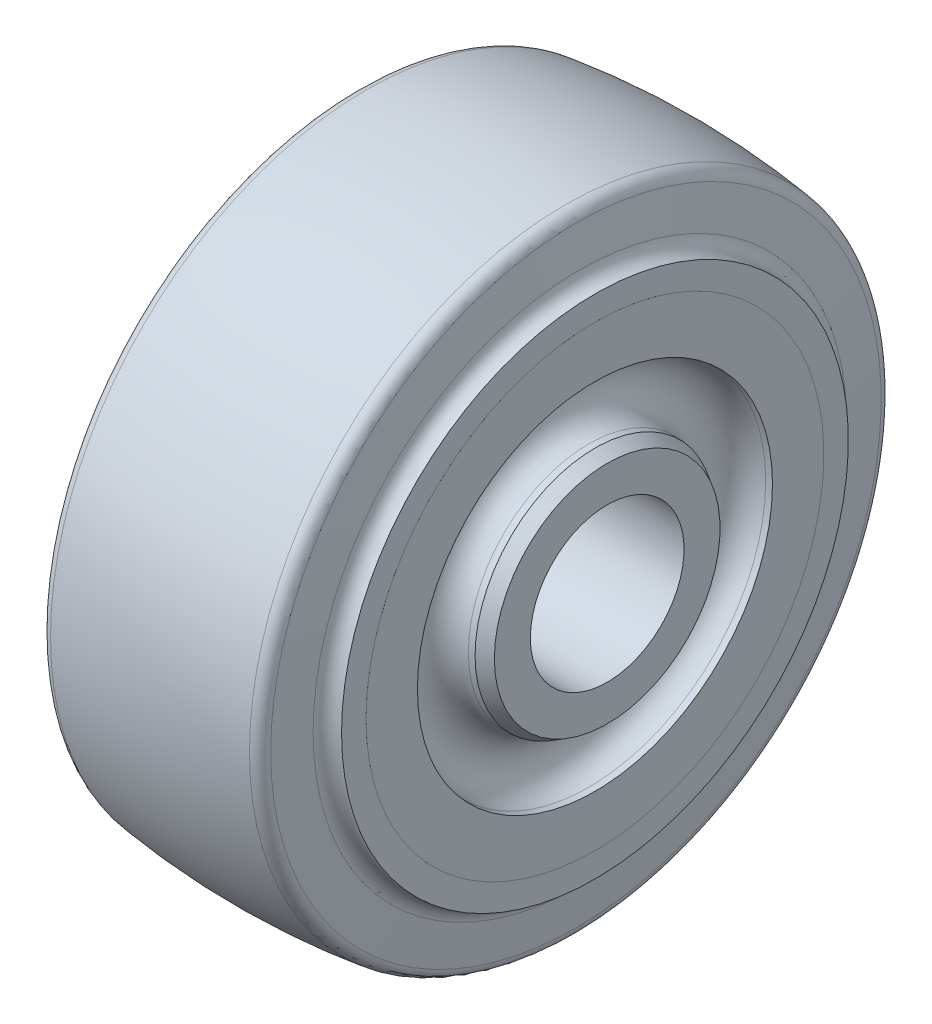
ISO-10303-21;
HEADER;
FILE_DESCRIPTION(('STEP AP214'),'2;1');
FILE_NAME('part.step','',(''),(''),'','','');
FILE_SCHEMA(('AUTOMOTIVE_DESIGN { 1 0 10303 214 1 1 1 1 }'));
ENDSEC;
DATA;
#1=APPLICATION_CONTEXT('core data for automotive mechanical design processes');
#2=APPLICATION_PROTOCOL_DEFINITION('international standard','automotive_design',2000,#1);
#3=PRODUCT_CONTEXT('',#1,'mechanical');
#4=PRODUCT('Part','Part','',(#3));
#5=PRODUCT_RELATED_PRODUCT_CATEGORY('part','',(#4));
#6=PRODUCT_DEFINITION_FORMATION('','',#4);
#7=PRODUCT_DEFINITION_CONTEXT('part definition',#1,'design');
#8=PRODUCT_DEFINITION('design','',#6,#7);
#9=PRODUCT_DEFINITION_SHAPE('','',#8);
#10=(LENGTH_UNIT() NAMED_UNIT(*) SI_UNIT(.MILLI.,.METRE.));
#11=(NAMED_UNIT(*) PLANE_ANGLE_UNIT() SI_UNIT($,.RADIAN.));
#12=(NAMED_UNIT(*) SI_UNIT($,.STERADIAN.) SOLID_ANGLE_UNIT());
#13=UNCERTAINTY_MEASURE_WITH_UNIT(LENGTH_MEASURE(1.E-05),#10,'distance_accuracy_value','');
#14=(GEOMETRIC_REPRESENTATION_CONTEXT(3) GLOBAL_UNCERTAINTY_ASSIGNED_CONTEXT((#13)) GLOBAL_UNIT_ASSIGNED_CONTEXT((#10,
#11,#12)) REPRESENTATION_CONTEXT('',''));
#15=CARTESIAN_POINT('',(0.,0.,0.));
#16=DIRECTION('',(0.,0.,1.));
#17=DIRECTION('',(1.,0.,0.));
#18=AXIS2_PLACEMENT_3D('',#15,#16,#17);
#19=CARTESIAN_POINT('',(25.4,0.,0.));
#20=DIRECTION('',(-1.,0.,0.));
#21=DIRECTION('',(0.,0.,1.));
#22=AXIS2_PLACEMENT_3D('',#19,#20,#21);
#23=CONICAL_SURFACE('',#22,23.618146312,0.0872664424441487);
#24=CARTESIAN_POINT('',(24.1827237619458,0.,0.));
#25=DIRECTION('',(-1.,0.,0.));
#26=DIRECTION('',(0.,0.,1.));
#27=AXIS2_PLACEMENT_3D('',#24,#25,#26);
#28=CIRCLE('',#27,23.7246441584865);
#29=CARTESIAN_POINT('',(24.1827237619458,0.,23.7246441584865));
#30=VERTEX_POINT('',#29);
#31=EDGE_CURVE('E10',#30,#30,#28,.T.);
#32=ORIENTED_EDGE('',*,*,#31,.F.);
#33=EDGE_LOOP('',(#32));
#34=FACE_BOUND('',#33,.T.);
#35=CARTESIAN_POINT('',(25.4,0.,0.));
#36=DIRECTION('',(-1.,0.,0.));
#37=DIRECTION('',(0.,0.,1.));
#38=AXIS2_PLACEMENT_3D('',#35,#36,#37);
#39=CIRCLE('',#38,23.618146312);
#40=CARTESIAN_POINT('',(25.4,0.,23.618146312));
#41=VERTEX_POINT('',#40);
#42=EDGE_CURVE('E436',#41,#41,#39,.T.);
#43=ORIENTED_EDGE('',*,*,#42,.T.);
#44=EDGE_LOOP('',(#43));
#45=FACE_BOUND('',#44,.T.);
#46=ADVANCED_FACE('F360',(#34,#45),#23,.T.);
#47=CARTESIAN_POINT('',(24.6697499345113,0.,0.));
#48=DIRECTION('',(-1.,0.,0.));
#49=DIRECTION('',(0.,0.,1.));
#50=AXIS2_PLACEMENT_3D('',#47,#48,#49);
#51=TOROIDAL_SURFACE('',#50,29.291380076,5.5879999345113);
#52=CARTESIAN_POINT('',(24.1827237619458,0.,0.));
#53=DIRECTION('',(-1.,0.,0.));
#54=DIRECTION('',(0.,0.,1.));
#55=AXIS2_PLACEMENT_3D('',#52,#53,#54);
#56=CIRCLE('',#55,34.8581159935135);
#57=CARTESIAN_POINT('',(24.1827237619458,0.,34.8581159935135));
#58=VERTEX_POINT('',#57);
#59=EDGE_CURVE('E366',#58,#58,#56,.T.);
#60=ORIENTED_EDGE('',*,*,#59,.F.);
#61=EDGE_LOOP('',(#60));
#62=FACE_BOUND('',#61,.T.);
#63=ORIENTED_EDGE('',*,*,#31,.T.);
#64=EDGE_LOOP('',(#63));
#65=FACE_BOUND('',#64,.T.);
#66=ADVANCED_FACE('F569',(#62,#65),#51,.F.);
#67=CARTESIAN_POINT('',(24.1827237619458,0.,0.));
#68=DIRECTION('',(1.,0.,0.));
#69=DIRECTION('',(0.,0.,-1.));
#70=AXIS2_PLACEMENT_3D('',#67,#68,#69);
#71=CONICAL_SURFACE('',#70,34.8581159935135,0.0872664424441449);
#72=CARTESIAN_POINT('',(25.4,0.,0.));
#73=DIRECTION('',(-1.,0.,0.));
#74=DIRECTION('',(0.,0.,1.));
#75=AXIS2_PLACEMENT_3D('',#72,#73,#74);
#76=CIRCLE('',#75,34.96461384);
#77=CARTESIAN_POINT('',(25.4,0.,34.96461384));
#78=VERTEX_POINT('',#77);
#79=EDGE_CURVE('E370',#78,#78,#76,.T.);
#80=ORIENTED_EDGE('',*,*,#79,.F.);
#81=EDGE_LOOP('',(#80));
#82=FACE_BOUND('',#81,.T.);
#83=ORIENTED_EDGE('',*,*,#59,.T.);
#84=EDGE_LOOP('',(#83));
#85=FACE_BOUND('',#84,.T.);
#86=ADVANCED_FACE('F564',(#82,#85),#71,.F.);
#87=CARTESIAN_POINT('',(25.4,34.96461384,0.));
#88=DIRECTION('',(-1.,0.,0.));
#89=DIRECTION('',(0.,0.,1.));
#90=AXIS2_PLACEMENT_3D('',#87,#88,#89);
#91=PLANE('',#90);
#92=CARTESIAN_POINT('',(25.4,0.,0.));
#93=DIRECTION('',(-1.,0.,0.));
#94=DIRECTION('',(0.,0.,1.));
#95=AXIS2_PLACEMENT_3D('',#92,#93,#94);
#96=CIRCLE('',#95,45.085);
#97=CARTESIAN_POINT('',(25.4,0.,45.085));
#98=VERTEX_POINT('',#97);
#99=EDGE_CURVE('E374',#98,#98,#96,.T.);
#100=ORIENTED_EDGE('',*,*,#99,.F.);
#101=EDGE_LOOP('',(#100));
#102=FACE_BOUND('',#101,.T.);
#103=ORIENTED_EDGE('',*,*,#79,.T.);
#104=EDGE_LOOP('',(#103));
#105=FACE_BOUND('',#104,.T.);
#106=ADVANCED_FACE('F558',(#102,#105),#91,.F.);
#107=CARTESIAN_POINT('',(-38.862204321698,0.,0.));
#108=DIRECTION('',(-1.,0.,0.));
#109=DIRECTION('',(0.,0.,1.));
#110=AXIS2_PLACEMENT_3D('',#107,#108,#109);
#111=CYLINDRICAL_SURFACE('',#110,45.085);
#112=CARTESIAN_POINT('',(25.39746,0.,0.));
#113=DIRECTION('',(-1.,0.,0.));
#114=DIRECTION('',(0.,0.,1.));
#115=AXIS2_PLACEMENT_3D('',#112,#113,#114);
#116=CIRCLE('',#115,45.085);
#117=CARTESIAN_POINT('',(25.39746,0.,45.085));
#118=VERTEX_POINT('',#117);
#119=EDGE_CURVE('E379',#118,#118,#116,.T.);
#120=ORIENTED_EDGE('',*,*,#119,.F.);
#121=EDGE_LOOP('',(#120));
#122=FACE_BOUND('',#121,.T.);
#123=ORIENTED_EDGE('',*,*,#99,.T.);
#124=EDGE_LOOP('',(#123));
#125=FACE_BOUND('',#124,.T.);
#126=ADVANCED_FACE('F552',(#122,#125),#111,.T.);
#127=CARTESIAN_POINT('',(25.39746,45.085,0.));
#128=DIRECTION('',(-1.,0.,0.));
#129=DIRECTION('',(0.,0.,1.));
#130=AXIS2_PLACEMENT_3D('',#127,#128,#129);
#131=PLANE('',#130);
#132=CARTESIAN_POINT('',(25.39746,0.,0.));
#133=DIRECTION('',(-1.,0.,0.));
#134=DIRECTION('',(0.,0.,1.));
#135=AXIS2_PLACEMENT_3D('',#132,#133,#134);
#136=CIRCLE('',#135,49.911);
#137=CARTESIAN_POINT('',(25.39746,0.,49.911));
#138=VERTEX_POINT('',#137);
#139=EDGE_CURVE('E382',#138,#138,#136,.T.);
#140=ORIENTED_EDGE('',*,*,#139,.F.);
#141=EDGE_LOOP('',(#140));
#142=FACE_BOUND('',#141,.T.);
#143=ORIENTED_EDGE('',*,*,#119,.T.);
#144=EDGE_LOOP('',(#143));
#145=FACE_BOUND('',#144,.T.);
#146=ADVANCED_FACE('F546',(#142,#145),#131,.F.);
#147=CARTESIAN_POINT('',(25.39746,0.,0.));
#148=DIRECTION('',(-1.,0.,0.));
#149=DIRECTION('',(0.,0.,1.));
#150=AXIS2_PLACEMENT_3D('',#147,#148,#149);
#151=TOROIDAL_SURFACE('',#150,52.8717194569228,2.96071945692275);
#152=CARTESIAN_POINT('',(22.452959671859,0.,0.));
#153=DIRECTION('',(-1.,0.,0.));
#154=DIRECTION('',(0.,0.,1.));
#155=AXIS2_PLACEMENT_3D('',#152,#153,#154);
#156=CIRCLE('',#155,52.5622400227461);
#157=CARTESIAN_POINT('',(22.452959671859,0.,52.5622400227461));
#158=VERTEX_POINT('',#157);
#159=EDGE_CURVE('E385',#158,#158,#156,.T.);
#160=ORIENTED_EDGE('',*,*,#159,.F.);
#161=EDGE_LOOP('',(#160));
#162=FACE_BOUND('',#161,.T.);
#163=ORIENTED_EDGE('',*,*,#139,.T.);
#164=EDGE_LOOP('',(#163));
#165=FACE_BOUND('',#164,.T.);
#166=ADVANCED_FACE('F540',(#162,#165),#151,.F.);
#167=CARTESIAN_POINT('',(22.452959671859,0.,0.));
#168=DIRECTION('',(-1.,0.,0.));
#169=DIRECTION('',(0.,0.,1.));
#170=AXIS2_PLACEMENT_3D('',#167,#168,#169);
#171=CONICAL_SURFACE('',#170,52.5622400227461,1.46607657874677);
#172=CARTESIAN_POINT('',(21.6583679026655,0.,0.));
#173=DIRECTION('',(-1.,0.,0.));
#174=DIRECTION('',(0.,0.,1.));
#175=AXIS2_PLACEMENT_3D('',#172,#173,#174);
#176=CIRCLE('',#175,60.1222762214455);
#177=CARTESIAN_POINT('',(21.6583679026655,0.,60.1222762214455));
#178=VERTEX_POINT('',#177);
#179=EDGE_CURVE('E388',#178,#178,#176,.T.);
#180=ORIENTED_EDGE('',*,*,#179,.F.);
#181=EDGE_LOOP('',(#180));
#182=FACE_BOUND('',#181,.T.);
#183=ORIENTED_EDGE('',*,*,#159,.T.);
#184=EDGE_LOOP('',(#183));
#185=FACE_BOUND('',#184,.T.);
#186=ADVANCED_FACE('F534',(#182,#185),#171,.T.);
#187=CARTESIAN_POINT('',(19.2901626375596,0.,0.));
#188=DIRECTION('',(-1.,0.,0.));
#189=DIRECTION('',(0.,0.,1.));
#190=AXIS2_PLACEMENT_3D('',#187,#188,#189);
#191=TOROIDAL_SURFACE('',#190,59.8733678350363,2.38125);
#192=CARTESIAN_POINT('',(19.5963556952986,0.,0.));
#193=DIRECTION('',(-1.,0.,0.));
#194=DIRECTION('',(0.,0.,1.));
#195=AXIS2_PLACEMENT_3D('',#192,#193,#194);
#196=CIRCLE('',#195,62.2348498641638);
#197=CARTESIAN_POINT('',(19.5963556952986,0.,62.2348498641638));
#198=VERTEX_POINT('',#197);
#199=EDGE_CURVE('E391',#198,#198,#196,.T.);
#200=ORIENTED_EDGE('',*,*,#199,.F.);
#201=EDGE_LOOP('',(#200));
#202=FACE_BOUND('',#201,.T.);
#203=ORIENTED_EDGE('',*,*,#179,.T.);
#204=EDGE_LOOP('',(#203));
#205=FACE_BOUND('',#204,.T.);
#206=ADVANCED_FACE('F528',(#202,#205),#191,.T.);
#207=CARTESIAN_POINT('',(0.,0.,0.));
#208=DIRECTION('',(-1.,0.,0.));
#209=DIRECTION('',(0.,0.,1.));
#210=AXIS2_PLACEMENT_3D('',#207,#208,#209);
#211=DEGENERATE_TOROIDAL_SURFACE('',#210,88.9,152.4,.F.);
#212=CARTESIAN_POINT('',(-19.5963556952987,0.,0.));
#213=DIRECTION('',(-1.,0.,0.));
#214=DIRECTION('',(0.,0.,1.));
#215=AXIS2_PLACEMENT_3D('',#212,#213,#214);
#216=CIRCLE('',#215,62.2348498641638);
#217=CARTESIAN_POINT('',(-19.5963556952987,0.,62.2348498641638));
#218=VERTEX_POINT('',#217);
#219=EDGE_CURVE('E394',#218,#218,#216,.T.);
#220=ORIENTED_EDGE('',*,*,#219,.F.);
#221=EDGE_LOOP('',(#220));
#222=FACE_BOUND('',#221,.T.);
#223=ORIENTED_EDGE('',*,*,#199,.T.);
#224=EDGE_LOOP('',(#223));
#225=FACE_BOUND('',#224,.T.);
#226=ADVANCED_FACE('F522',(#222,#225),#211,.F.);
#227=CARTESIAN_POINT('',(-19.2901626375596,0.,0.));
#228=DIRECTION('',(-1.,0.,0.));
#229=DIRECTION('',(0.,0.,1.));
#230=AXIS2_PLACEMENT_3D('',#227,#228,#229);
#231=TOROIDAL_SURFACE('',#230,59.8733678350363,2.38124999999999);
#232=CARTESIAN_POINT('',(-21.6583679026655,0.,0.));
#233=DIRECTION('',(-1.,0.,0.));
#234=DIRECTION('',(0.,0.,1.));
#235=AXIS2_PLACEMENT_3D('',#232,#233,#234);
#236=CIRCLE('',#235,60.1222762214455);
#237=CARTESIAN_POINT('',(-21.6583679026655,0.,60.1222762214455));
#238=VERTEX_POINT('',#237);
#239=EDGE_CURVE('E397',#238,#238,#236,.T.);
#240=ORIENTED_EDGE('',*,*,#239,.F.);
#241=EDGE_LOOP('',(#240));
#242=FACE_BOUND('',#241,.T.);
#243=ORIENTED_EDGE('',*,*,#219,.T.);
#244=EDGE_LOOP('',(#243));
#245=FACE_BOUND('',#244,.T.);
#246=ADVANCED_FACE('F516',(#242,#245),#231,.T.);
#247=CARTESIAN_POINT('',(-21.6583679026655,0.,0.));
#248=DIRECTION('',(1.,0.,0.));
#249=DIRECTION('',(0.,0.,-1.));
#250=AXIS2_PLACEMENT_3D('',#247,#248,#249);
#251=CONICAL_SURFACE('',#250,60.1222762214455,1.46607657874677);
#252=CARTESIAN_POINT('',(-22.452959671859,0.,0.));
#253=DIRECTION('',(-1.,0.,0.));
#254=DIRECTION('',(0.,0.,1.));
#255=AXIS2_PLACEMENT_3D('',#252,#253,#254);
#256=CIRCLE('',#255,52.5622400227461);
#257=CARTESIAN_POINT('',(-22.452959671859,0.,52.5622400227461));
#258=VERTEX_POINT('',#257);
#259=EDGE_CURVE('E400',#258,#258,#256,.T.);
#260=ORIENTED_EDGE('',*,*,#259,.F.);
#261=EDGE_LOOP('',(#260));
#262=FACE_BOUND('',#261,.T.);
#263=ORIENTED_EDGE('',*,*,#239,.T.);
#264=EDGE_LOOP('',(#263));
#265=FACE_BOUND('',#264,.T.);
#266=ADVANCED_FACE('F510',(#262,#265),#251,.T.);
#267=CARTESIAN_POINT('',(-25.39746,0.,0.));
#268=DIRECTION('',(-1.,0.,0.));
#269=DIRECTION('',(0.,0.,1.));
#270=AXIS2_PLACEMENT_3D('',#267,#268,#269);
#271=TOROIDAL_SURFACE('',#270,52.8717194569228,2.96071945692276);
#272=CARTESIAN_POINT('',(-25.39746,0.,0.));
#273=DIRECTION('',(-1.,0.,0.));
#274=DIRECTION('',(0.,0.,1.));
#275=AXIS2_PLACEMENT_3D('',#272,#273,#274);
#276=CIRCLE('',#275,49.911);
#277=CARTESIAN_POINT('',(-25.39746,0.,49.911));
#278=VERTEX_POINT('',#277);
#279=EDGE_CURVE('E403',#278,#278,#276,.T.);
#280=ORIENTED_EDGE('',*,*,#279,.F.);
#281=EDGE_LOOP('',(#280));
#282=FACE_BOUND('',#281,.T.);
#283=ORIENTED_EDGE('',*,*,#259,.T.);
#284=EDGE_LOOP('',(#283));
#285=FACE_BOUND('',#284,.T.);
#286=ADVANCED_FACE('F504',(#282,#285),#271,.F.);
#287=CARTESIAN_POINT('',(-25.39746,49.911,0.));
#288=DIRECTION('',(1.,0.,0.));
#289=DIRECTION('',(0.,0.,-1.));
#290=AXIS2_PLACEMENT_3D('',#287,#288,#289);
#291=PLANE('',#290);
#292=CARTESIAN_POINT('',(-25.39746,0.,0.));
#293=DIRECTION('',(-1.,0.,0.));
#294=DIRECTION('',(0.,0.,1.));
#295=AXIS2_PLACEMENT_3D('',#292,#293,#294);
#296=CIRCLE('',#295,45.085);
#297=CARTESIAN_POINT('',(-25.39746,0.,45.085));
#298=VERTEX_POINT('',#297);
#299=EDGE_CURVE('E406',#298,#298,#296,.T.);
#300=ORIENTED_EDGE('',*,*,#299,.F.);
#301=EDGE_LOOP('',(#300));
#302=FACE_BOUND('',#301,.T.);
#303=ORIENTED_EDGE('',*,*,#279,.T.);
#304=EDGE_LOOP('',(#303));
#305=FACE_BOUND('',#304,.T.);
#306=ADVANCED_FACE('F498',(#302,#305),#291,.F.);
#307=CARTESIAN_POINT('',(-38.862204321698,0.,0.));
#308=DIRECTION('',(-1.,0.,0.));
#309=DIRECTION('',(0.,0.,1.));
#310=AXIS2_PLACEMENT_3D('',#307,#308,#309);
#311=CYLINDRICAL_SURFACE('',#310,45.085);
#312=CARTESIAN_POINT('',(-25.4,0.,0.));
#313=DIRECTION('',(-1.,0.,0.));
#314=DIRECTION('',(0.,0.,1.));
#315=AXIS2_PLACEMENT_3D('',#312,#313,#314);
#316=CIRCLE('',#315,45.085);
#317=CARTESIAN_POINT('',(-25.4,0.,45.085));
#318=VERTEX_POINT('',#317);
#319=EDGE_CURVE('E409',#318,#318,#316,.T.);
#320=ORIENTED_EDGE('',*,*,#319,.F.);
#321=EDGE_LOOP('',(#320));
#322=FACE_BOUND('',#321,.T.);
#323=ORIENTED_EDGE('',*,*,#299,.T.);
#324=EDGE_LOOP('',(#323));
#325=FACE_BOUND('',#324,.T.);
#326=ADVANCED_FACE('F492',(#322,#325),#311,.T.);
#327=CARTESIAN_POINT('',(-25.4,45.085,0.));
#328=DIRECTION('',(1.,0.,0.));
#329=DIRECTION('',(0.,0.,-1.));
#330=AXIS2_PLACEMENT_3D('',#327,#328,#329);
#331=PLANE('',#330);
#332=CARTESIAN_POINT('',(-25.4,0.,0.));
#333=DIRECTION('',(-1.,0.,0.));
#334=DIRECTION('',(0.,0.,1.));
#335=AXIS2_PLACEMENT_3D('',#332,#333,#334);
#336=CIRCLE('',#335,34.96461384);
#337=CARTESIAN_POINT('',(-25.4,0.,34.96461384));
#338=VERTEX_POINT('',#337);
#339=EDGE_CURVE('E412',#338,#338,#336,.T.);
#340=ORIENTED_EDGE('',*,*,#339,.F.);
#341=EDGE_LOOP('',(#340));
#342=FACE_BOUND('',#341,.T.);
#343=ORIENTED_EDGE('',*,*,#319,.T.);
#344=EDGE_LOOP('',(#343));
#345=FACE_BOUND('',#344,.T.);
#346=ADVANCED_FACE('F486',(#342,#345),#331,.F.);
#347=CARTESIAN_POINT('',(-25.4,0.,0.));
#348=DIRECTION('',(-1.,0.,0.));
#349=DIRECTION('',(0.,0.,1.));
#350=AXIS2_PLACEMENT_3D('',#347,#348,#349);
#351=CONICAL_SURFACE('',#350,34.96461384,0.0872664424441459);
#352=CARTESIAN_POINT('',(-24.1827237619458,0.,0.));
#353=DIRECTION('',(-1.,0.,0.));
#354=DIRECTION('',(0.,0.,1.));
#355=AXIS2_PLACEMENT_3D('',#352,#353,#354);
#356=CIRCLE('',#355,34.8581159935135);
#357=CARTESIAN_POINT('',(-24.1827237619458,0.,34.8581159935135));
#358=VERTEX_POINT('',#357);
#359=EDGE_CURVE('E415',#358,#358,#356,.T.);
#360=ORIENTED_EDGE('',*,*,#359,.F.);
#361=EDGE_LOOP('',(#360));
#362=FACE_BOUND('',#361,.T.);
#363=ORIENTED_EDGE('',*,*,#339,.T.);
#364=EDGE_LOOP('',(#363));
#365=FACE_BOUND('',#364,.T.);
#366=ADVANCED_FACE('F480',(#362,#365),#351,.F.);
#367=CARTESIAN_POINT('',(-24.6697499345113,0.,0.));
#368=DIRECTION('',(-1.,0.,0.));
#369=DIRECTION('',(0.,0.,1.));
#370=AXIS2_PLACEMENT_3D('',#367,#368,#369);
#371=TOROIDAL_SURFACE('',#370,29.291380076,5.5879999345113);
#372=CARTESIAN_POINT('',(-24.1827237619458,0.,0.));
#373=DIRECTION('',(-1.,0.,0.));
#374=DIRECTION('',(0.,0.,1.));
#375=AXIS2_PLACEMENT_3D('',#372,#373,#374);
#376=CIRCLE('',#375,23.7246441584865);
#377=CARTESIAN_POINT('',(-24.1827237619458,0.,23.7246441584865));
#378=VERTEX_POINT('',#377);
#379=EDGE_CURVE('E418',#378,#378,#376,.T.);
#380=ORIENTED_EDGE('',*,*,#379,.F.);
#381=EDGE_LOOP('',(#380));
#382=FACE_BOUND('',#381,.T.);
#383=ORIENTED_EDGE('',*,*,#359,.T.);
#384=EDGE_LOOP('',(#383));
#385=FACE_BOUND('',#384,.T.);
#386=ADVANCED_FACE('F474',(#382,#385),#371,.F.);
#387=CARTESIAN_POINT('',(-24.1827237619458,0.,0.));
#388=DIRECTION('',(1.,0.,0.));
#389=DIRECTION('',(0.,0.,-1.));
#390=AXIS2_PLACEMENT_3D('',#387,#388,#389);
#391=CONICAL_SURFACE('',#390,23.7246441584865,0.087266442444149);
#392=CARTESIAN_POINT('',(-25.4,0.,0.));
#393=DIRECTION('',(-1.,0.,0.));
#394=DIRECTION('',(0.,0.,1.));
#395=AXIS2_PLACEMENT_3D('',#392,#393,#394);
#396=CIRCLE('',#395,23.618146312);
#397=CARTESIAN_POINT('',(-25.4,0.,23.618146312));
#398=VERTEX_POINT('',#397);
#399=EDGE_CURVE('E421',#398,#398,#396,.T.);
#400=ORIENTED_EDGE('',*,*,#399,.F.);
#401=EDGE_LOOP('',(#400));
#402=FACE_BOUND('',#401,.T.);
#403=ORIENTED_EDGE('',*,*,#379,.T.);
#404=EDGE_LOOP('',(#403));
#405=FACE_BOUND('',#404,.T.);
#406=ADVANCED_FACE('F468',(#402,#405),#391,.T.);
#407=CARTESIAN_POINT('',(-25.4,0.,0.));
#408=DIRECTION('',(1.,0.,0.));
#409=DIRECTION('',(0.,0.,-1.));
#410=AXIS2_PLACEMENT_3D('',#407,#408,#409);
#411=CONICAL_SURFACE('',#410,23.618146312,0.523598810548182);
#412=CARTESIAN_POINT('',(-27.813,0.,0.));
#413=DIRECTION('',(-1.,0.,0.));
#414=DIRECTION('',(0.,0.,1.));
#415=AXIS2_PLACEMENT_3D('',#412,#413,#414);
#416=CIRCLE('',#415,22.225);
#417=CARTESIAN_POINT('',(-27.813,0.,22.225));
#418=VERTEX_POINT('',#417);
#419=EDGE_CURVE('E424',#418,#418,#416,.T.);
#420=ORIENTED_EDGE('',*,*,#419,.F.);
#421=EDGE_LOOP('',(#420));
#422=FACE_BOUND('',#421,.T.);
#423=ORIENTED_EDGE('',*,*,#399,.T.);
#424=EDGE_LOOP('',(#423));
#425=FACE_BOUND('',#424,.T.);
#426=ADVANCED_FACE('F462',(#422,#425),#411,.T.);
#427=CARTESIAN_POINT('',(-27.813,15.1384,0.));
#428=DIRECTION('',(1.,0.,0.));
#429=DIRECTION('',(0.,0.,-1.));
#430=AXIS2_PLACEMENT_3D('',#427,#428,#429);
#431=PLANE('',#430);
#432=CARTESIAN_POINT('',(-27.813,0.,0.));
#433=DIRECTION('',(-1.,0.,0.));
#434=DIRECTION('',(0.,0.,1.));
#435=AXIS2_PLACEMENT_3D('',#432,#433,#434);
#436=CIRCLE('',#435,15.1384);
#437=CARTESIAN_POINT('',(-27.813,0.,15.1384));
#438=VERTEX_POINT('',#437);
#439=EDGE_CURVE('E427',#438,#438,#436,.T.);
#440=ORIENTED_EDGE('',*,*,#439,.F.);
#441=EDGE_LOOP('',(#440));
#442=FACE_BOUND('',#441,.T.);
#443=ORIENTED_EDGE('',*,*,#419,.T.);
#444=EDGE_LOOP('',(#443));
#445=FACE_BOUND('',#444,.T.);
#446=ADVANCED_FACE('F456',(#442,#445),#431,.F.);
#447=CARTESIAN_POINT('',(-38.862204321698,0.,0.));
#448=DIRECTION('',(-1.,0.,0.));
#449=DIRECTION('',(0.,0.,1.));
#450=AXIS2_PLACEMENT_3D('',#447,#448,#449);
#451=CYLINDRICAL_SURFACE('',#450,15.1384);
#452=CARTESIAN_POINT('',(27.813,0.,0.));
#453=DIRECTION('',(-1.,0.,0.));
#454=DIRECTION('',(0.,0.,1.));
#455=AXIS2_PLACEMENT_3D('',#452,#453,#454);
#456=CIRCLE('',#455,15.1384);
#457=CARTESIAN_POINT('',(27.813,0.,15.1384));
#458=VERTEX_POINT('',#457);
#459=EDGE_CURVE('E430',#458,#458,#456,.T.);
#460=ORIENTED_EDGE('',*,*,#459,.F.);
#461=EDGE_LOOP('',(#460));
#462=FACE_BOUND('',#461,.T.);
#463=ORIENTED_EDGE('',*,*,#439,.T.);
#464=EDGE_LOOP('',(#463));
#465=FACE_BOUND('',#464,.T.);
#466=ADVANCED_FACE('F450',(#462,#465),#451,.F.);
#467=CARTESIAN_POINT('',(27.813,22.225,0.));
#468=DIRECTION('',(-1.,0.,0.));
#469=DIRECTION('',(0.,0.,1.));
#470=AXIS2_PLACEMENT_3D('',#467,#468,#469);
#471=PLANE('',#470);
#472=CARTESIAN_POINT('',(27.813,0.,0.));
#473=DIRECTION('',(-1.,0.,0.));
#474=DIRECTION('',(0.,0.,1.));
#475=AXIS2_PLACEMENT_3D('',#472,#473,#474);
#476=CIRCLE('',#475,22.225);
#477=CARTESIAN_POINT('',(27.813,0.,22.225));
#478=VERTEX_POINT('',#477);
#479=EDGE_CURVE('E433',#478,#478,#476,.T.);
#480=ORIENTED_EDGE('',*,*,#479,.F.);
#481=EDGE_LOOP('',(#480));
#482=FACE_BOUND('',#481,.T.);
#483=ORIENTED_EDGE('',*,*,#459,.T.);
#484=EDGE_LOOP('',(#483));
#485=FACE_BOUND('',#484,.T.);
#486=ADVANCED_FACE('F444',(#482,#485),#471,.F.);
#487=CARTESIAN_POINT('',(27.813,0.,0.));
#488=DIRECTION('',(-1.,0.,0.));
#489=DIRECTION('',(0.,0.,1.));
#490=AXIS2_PLACEMENT_3D('',#487,#488,#489);
#491=CONICAL_SURFACE('',#490,22.225,0.523598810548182);
#492=ORIENTED_EDGE('',*,*,#42,.F.);
#493=EDGE_LOOP('',(#492));
#494=FACE_BOUND('',#493,.T.);
#495=ORIENTED_EDGE('',*,*,#479,.T.);
#496=EDGE_LOOP('',(#495));
#497=FACE_BOUND('',#496,.T.);
#498=ADVANCED_FACE('F441',(#494,#497),#491,.T.);
#499=CLOSED_SHELL('',(#46,#66,#86,#106,#126,#146,#166,#186,#206,#226,#246,#266,#286,#306,#326,
#346,#366,#386,#406,#426,#446,#466,#486,#498));
#500=MANIFOLD_SOLID_BREP('B2',#499);
#501=ADVANCED_BREP_SHAPE_REPRESENTATION('',(#18,#500),#14);
#502=SHAPE_DEFINITION_REPRESENTATION(#9,#501);
ENDSEC;
END-ISO-10303-21;
